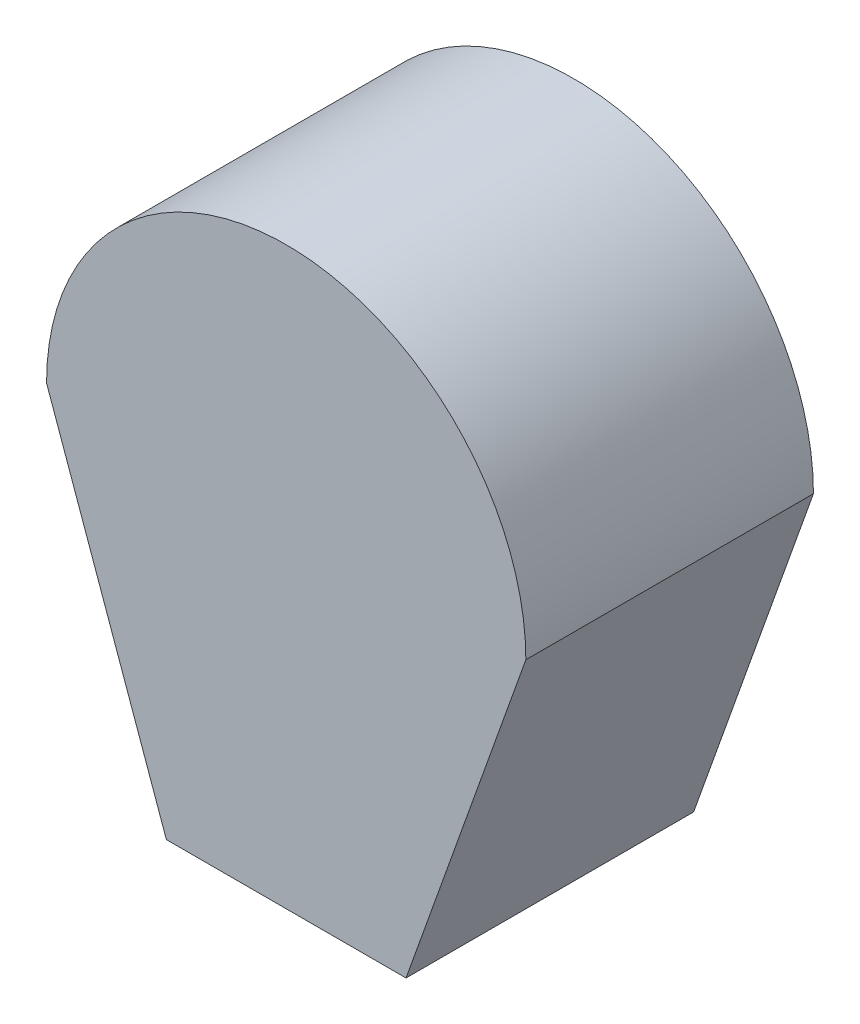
from build123d import *

# Parameters (mm, degrees)
BOSS_EXTRU_1_DEPTH      = 30
BOSS_EXTRU_1_DEPTH_BACK = 30
ESQUISSE2_R             = 15
BOSS_EXTRU_2_DEPTH      = 5


with BuildPart() as part:
    # Esquisse1 → Boss.-Extru.1 (new, two sides: drawn at the far end of the back side and taken through both)
    with BuildSketch(Plane.XY.offset(-BOSS_EXTRU_1_DEPTH_BACK)):
        with BuildLine():
            Line((0, -70), (-25, -70))
            Line((-25, -70), (-50, 0))
            ThreePointArc((-50, 0), (0, 50), (50, 0))
            Line((50, 0), (25, -70))
            Line((25, -70), (0, -70))
        make_face()
    extrude(amount=BOSS_EXTRU_1_DEPTH + BOSS_EXTRU_1_DEPTH_BACK)

    # Esquisse2 → Boss.-Extru.2 (add)
    with BuildSketch(Plane.XZ.offset(70)):
        with Locations(Location((0, 0, 0), (0, 0, 270))):
            Circle(ESQUISSE2_R)
    extrude(amount=BOSS_EXTRU_2_DEPTH)


solid = part.part
